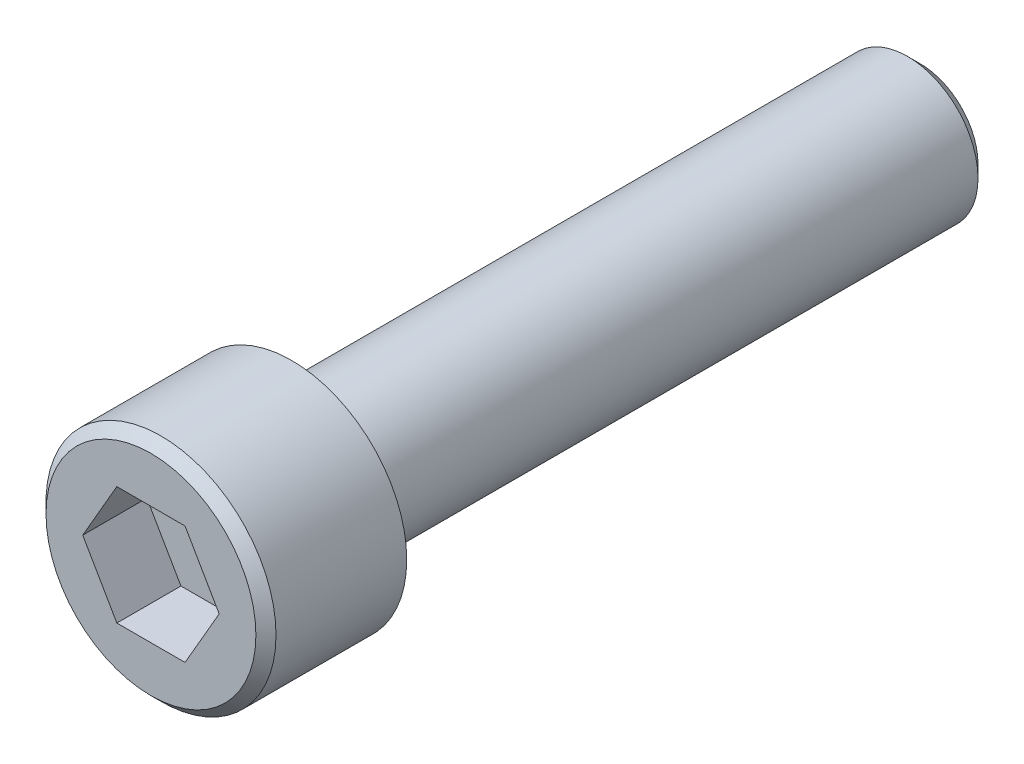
ISO-10303-21;
HEADER;
FILE_DESCRIPTION(('STEP AP214'),'2;1');
FILE_NAME('part.step','',(''),(''),'','','');
FILE_SCHEMA(('AUTOMOTIVE_DESIGN { 1 0 10303 214 1 1 1 1 }'));
ENDSEC;
DATA;
#1=APPLICATION_CONTEXT('core data for automotive mechanical design processes');
#2=APPLICATION_PROTOCOL_DEFINITION('international standard','automotive_design',2000,#1);
#3=PRODUCT_CONTEXT('',#1,'mechanical');
#4=PRODUCT('Part','Part','',(#3));
#5=PRODUCT_RELATED_PRODUCT_CATEGORY('part','',(#4));
#6=PRODUCT_DEFINITION_FORMATION('','',#4);
#7=PRODUCT_DEFINITION_CONTEXT('part definition',#1,'design');
#8=PRODUCT_DEFINITION('design','',#6,#7);
#9=PRODUCT_DEFINITION_SHAPE('','',#8);
#10=(LENGTH_UNIT() NAMED_UNIT(*) SI_UNIT(.MILLI.,.METRE.));
#11=(NAMED_UNIT(*) PLANE_ANGLE_UNIT() SI_UNIT($,.RADIAN.));
#12=(NAMED_UNIT(*) SI_UNIT($,.STERADIAN.) SOLID_ANGLE_UNIT());
#13=UNCERTAINTY_MEASURE_WITH_UNIT(LENGTH_MEASURE(1.E-05),#10,'distance_accuracy_value','');
#14=(GEOMETRIC_REPRESENTATION_CONTEXT(3) GLOBAL_UNCERTAINTY_ASSIGNED_CONTEXT((#13)) GLOBAL_UNIT_ASSIGNED_CONTEXT((#10,
#11,#12)) REPRESENTATION_CONTEXT('',''));
#15=CARTESIAN_POINT('',(0.,0.,0.));
#16=DIRECTION('',(0.,0.,1.));
#17=DIRECTION('',(1.,0.,0.));
#18=AXIS2_PLACEMENT_3D('',#15,#16,#17);
#19=CARTESIAN_POINT('',(-8.88178419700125E-13,-4.44089209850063E-13,-2.84480000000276));
#20=DIRECTION('',(0.,0.,0.999999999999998));
#21=DIRECTION('',(1.,0.,0.));
#22=AXIS2_PLACEMENT_3D('',#19,#20,#21);
#23=PLANE('',#22);
#24=CARTESIAN_POINT('',(-8.88178419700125E-13,-4.44089209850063E-13,-2.84480000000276));
#25=DIRECTION('',(0.,0.,0.999999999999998));
#26=DIRECTION('',(1.,0.,0.));
#27=AXIS2_PLACEMENT_3D('',#24,#25,#26);
#28=CIRCLE('',#27,2.3241);
#29=CARTESIAN_POINT('',(2.32409999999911,-4.43960196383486E-13,-2.84480000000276));
#30=VERTEX_POINT('',#29);
#31=EDGE_CURVE('E143',#30,#30,#28,.T.);
#32=ORIENTED_EDGE('',*,*,#31,.F.);
#33=EDGE_LOOP('',(#32));
#34=FACE_BOUND('',#33,.T.);
#35=CARTESIAN_POINT('',(-8.88178419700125E-13,-4.44089209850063E-13,-2.84480000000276));
#36=DIRECTION('',(0.,0.,0.999999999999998));
#37=DIRECTION('',(1.,0.,0.));
#38=AXIS2_PLACEMENT_3D('',#35,#36,#37);
#39=CIRCLE('',#38,1.4224);
#40=CARTESIAN_POINT('',(1.42239999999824,1.77643579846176E-12,-2.84480000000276));
#41=VERTEX_POINT('',#40);
#42=EDGE_CURVE('E151',#41,#41,#39,.F.);
#43=ORIENTED_EDGE('',*,*,#42,.F.);
#44=EDGE_LOOP('',(#43));
#45=FACE_BOUND('',#44,.T.);
#46=ADVANCED_FACE('F40',(#34,#45),#23,.F.);
#47=CARTESIAN_POINT('',(-8.88178419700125E-13,-4.44089209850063E-13,-2.84480000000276));
#48=DIRECTION('',(0.,0.,0.999999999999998));
#49=DIRECTION('',(1.,0.,0.));
#50=AXIS2_PLACEMENT_3D('',#47,#48,#49);
#51=CYLINDRICAL_SURFACE('',#50,2.3241);
#52=CARTESIAN_POINT('',(1.77635683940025E-12,4.44089209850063E-13,-0.203200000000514));
#53=DIRECTION('',(0.,0.,0.999999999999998));
#54=DIRECTION('',(1.,0.,0.));
#55=AXIS2_PLACEMENT_3D('',#52,#53,#54);
#56=CIRCLE('',#55,2.3241);
#57=CARTESIAN_POINT('',(2.32409999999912,-4.43960196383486E-13,-0.203200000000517));
#58=VERTEX_POINT('',#57);
#59=EDGE_CURVE('E11',#58,#58,#56,.F.);
#60=CARTESIAN_POINT('',(2.32409999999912,-4.43960196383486E-13,-0.203200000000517));
#61=CARTESIAN_POINT('',(2.32409999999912,-4.43960196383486E-13,-0.230716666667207));
#62=CARTESIAN_POINT('',(2.32409999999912,-4.43960196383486E-13,-0.258233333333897));
#63=CARTESIAN_POINT('',(2.32409999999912,-4.43960196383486E-13,-0.313266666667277));
#64=CARTESIAN_POINT('',(2.32409999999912,-4.43960196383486E-13,-0.340783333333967));
#65=CARTESIAN_POINT('',(2.32409999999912,-4.43960196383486E-13,-0.395816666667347));
#66=CARTESIAN_POINT('',(2.32409999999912,-4.43960196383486E-13,-0.423333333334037));
#67=CARTESIAN_POINT('',(2.32409999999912,-4.43960196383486E-13,-0.478366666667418));
#68=CARTESIAN_POINT('',(2.32409999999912,-4.43960196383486E-13,-0.505883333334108));
#69=CARTESIAN_POINT('',(2.32409999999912,-4.43960196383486E-13,-0.560916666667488));
#70=CARTESIAN_POINT('',(2.32409999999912,-4.43960196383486E-13,-0.588433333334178));
#71=CARTESIAN_POINT('',(2.32409999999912,-4.43960196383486E-13,-0.643466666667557));
#72=CARTESIAN_POINT('',(2.32409999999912,-4.43960196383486E-13,-0.670983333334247));
#73=CARTESIAN_POINT('',(2.32409999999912,-4.43960196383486E-13,-0.726016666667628));
#74=CARTESIAN_POINT('',(2.32409999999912,-4.43960196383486E-13,-0.753533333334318));
#75=CARTESIAN_POINT('',(2.32409999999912,-4.43960196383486E-13,-0.808566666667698));
#76=CARTESIAN_POINT('',(2.32409999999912,-4.43960196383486E-13,-0.836083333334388));
#77=CARTESIAN_POINT('',(2.32409999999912,-4.43960196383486E-13,-0.891116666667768));
#78=CARTESIAN_POINT('',(2.32409999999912,-4.43960196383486E-13,-0.918633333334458));
#79=CARTESIAN_POINT('',(2.32409999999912,-4.43960196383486E-13,-0.973666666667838));
#80=CARTESIAN_POINT('',(2.32409999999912,-4.43960196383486E-13,-1.00118333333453));
#81=CARTESIAN_POINT('',(2.32409999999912,-4.43960196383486E-13,-1.05621666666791));
#82=CARTESIAN_POINT('',(2.32409999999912,-4.43960196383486E-13,-1.0837333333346));
#83=CARTESIAN_POINT('',(2.32409999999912,-4.43960196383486E-13,-1.13876666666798));
#84=CARTESIAN_POINT('',(2.32409999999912,-4.43960196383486E-13,-1.16628333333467));
#85=CARTESIAN_POINT('',(2.32409999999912,-4.43960196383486E-13,-1.22131666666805));
#86=CARTESIAN_POINT('',(2.32409999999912,-4.43960196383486E-13,-1.24883333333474));
#87=CARTESIAN_POINT('',(2.32409999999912,-4.43960196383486E-13,-1.30386666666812));
#88=CARTESIAN_POINT('',(2.32409999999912,-4.43960196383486E-13,-1.33138333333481));
#89=CARTESIAN_POINT('',(2.32409999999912,-4.43960196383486E-13,-1.38641666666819));
#90=CARTESIAN_POINT('',(2.32409999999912,-4.43960196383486E-13,-1.41393333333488));
#91=CARTESIAN_POINT('',(2.32409999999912,-4.43960196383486E-13,-1.46896666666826));
#92=CARTESIAN_POINT('',(2.32409999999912,-4.43960196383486E-13,-1.49648333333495));
#93=CARTESIAN_POINT('',(2.32409999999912,-4.43960196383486E-13,-1.55151666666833));
#94=CARTESIAN_POINT('',(2.32409999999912,-4.43960196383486E-13,-1.57903333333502));
#95=CARTESIAN_POINT('',(2.32409999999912,-4.43960196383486E-13,-1.6340666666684));
#96=CARTESIAN_POINT('',(2.32409999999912,-4.43960196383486E-13,-1.66158333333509));
#97=CARTESIAN_POINT('',(2.32409999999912,-4.43960196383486E-13,-1.71661666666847));
#98=CARTESIAN_POINT('',(2.32409999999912,-4.43960196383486E-13,-1.74413333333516));
#99=CARTESIAN_POINT('',(2.32409999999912,-4.43960196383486E-13,-1.79916666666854));
#100=CARTESIAN_POINT('',(2.32409999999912,-4.43960196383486E-13,-1.82668333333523));
#101=CARTESIAN_POINT('',(2.32409999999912,-4.43960196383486E-13,-1.88171666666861));
#102=CARTESIAN_POINT('',(2.32409999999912,-4.43960196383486E-13,-1.9092333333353));
#103=CARTESIAN_POINT('',(2.32409999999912,-4.43960196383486E-13,-1.96426666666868));
#104=CARTESIAN_POINT('',(2.32409999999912,-4.43960196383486E-13,-1.99178333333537));
#105=CARTESIAN_POINT('',(2.32409999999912,-4.43960196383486E-13,-2.04681666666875));
#106=CARTESIAN_POINT('',(2.32409999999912,-4.43960196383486E-13,-2.07433333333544));
#107=CARTESIAN_POINT('',(2.32409999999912,-4.43960196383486E-13,-2.12936666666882));
#108=CARTESIAN_POINT('',(2.32409999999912,-4.43960196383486E-13,-2.15688333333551));
#109=CARTESIAN_POINT('',(2.32409999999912,-4.43960196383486E-13,-2.21191666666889));
#110=CARTESIAN_POINT('',(2.32409999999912,-4.43960196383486E-13,-2.23943333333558));
#111=CARTESIAN_POINT('',(2.32409999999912,-4.43960196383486E-13,-2.29446666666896));
#112=CARTESIAN_POINT('',(2.32409999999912,-4.43960196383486E-13,-2.32198333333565));
#113=CARTESIAN_POINT('',(2.32409999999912,-4.43960196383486E-13,-2.37701666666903));
#114=CARTESIAN_POINT('',(2.32409999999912,-4.43960196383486E-13,-2.40453333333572));
#115=CARTESIAN_POINT('',(2.32409999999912,-4.43960196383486E-13,-2.4595666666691));
#116=CARTESIAN_POINT('',(2.32409999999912,-4.43960196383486E-13,-2.48708333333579));
#117=CARTESIAN_POINT('',(2.32409999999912,-4.43960196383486E-13,-2.54211666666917));
#118=CARTESIAN_POINT('',(2.32409999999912,-4.43960196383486E-13,-2.56963333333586));
#119=CARTESIAN_POINT('',(2.32409999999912,-4.43960196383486E-13,-2.62466666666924));
#120=CARTESIAN_POINT('',(2.32409999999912,-4.43960196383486E-13,-2.65218333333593));
#121=CARTESIAN_POINT('',(2.32409999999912,-4.43960196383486E-13,-2.70721666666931));
#122=CARTESIAN_POINT('',(2.32409999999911,-4.43960196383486E-13,-2.734733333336));
#123=CARTESIAN_POINT('',(2.32409999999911,-4.43960196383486E-13,-2.78976666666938));
#124=CARTESIAN_POINT('',(2.32409999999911,-4.43960196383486E-13,-2.81728333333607));
#125=CARTESIAN_POINT('',(2.32409999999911,-4.43960196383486E-13,-2.84480000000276));
#126=B_SPLINE_CURVE_WITH_KNOTS('',3,(#60,#61,#62,#63,#64,#65,#66,#67,#68,#69,#70,#71,#72,#73,
#74,#75,#76,#77,#78,#79,#80,#81,#82,#83,#84,#85,#86,#87,#88,#89,#90,#91,#92,#93,#94,#95,#96,#97,
#98,#99,#100,#101,#102,#103,#104,#105,#106,#107,#108,#109,#110,#111,#112,#113,#114,#115,#116,
#117,#118,#119,#120,#121,#122,#123,#124,#125),.UNSPECIFIED.,.F.,.F.,(4,2,2,2,2,2,2,2,2,2,2,2,2,
2,2,2,2,2,2,2,2,2,2,2,2,2,2,2,2,2,2,2,4),(0.,0.0825500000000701,0.16510000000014,
0.24765000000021,0.330200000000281,0.41275000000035,0.49530000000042,0.577850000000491,
0.660400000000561,0.742950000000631,0.825500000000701,0.908050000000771,0.990600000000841,
1.07315000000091,1.15570000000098,1.23825000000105,1.32080000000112,1.40335000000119,
1.48590000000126,1.56845000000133,1.6510000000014,1.73355000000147,1.81610000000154,
1.89865000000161,1.98120000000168,2.06375000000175,2.14630000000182,2.22885000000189,
2.31140000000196,2.39395000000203,2.4765000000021,2.55905000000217,2.64160000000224),.UNSPECIFIED.);
#127=EDGE_CURVE('BSEAM179',#58,#30,#126,.T.);
#128=ORIENTED_EDGE('',*,*,#59,.T.);
#129=ORIENTED_EDGE('',*,*,#31,.T.);
#130=ORIENTED_EDGE('',*,*,#127,.T.);
#131=ORIENTED_EDGE('',*,*,#127,.F.);
#132=EDGE_LOOP('',(#128,#130,#129,#131));
#133=FACE_BOUND('',#132,.T.);
#134=ADVANCED_FACE('F179',(#133),#51,.T.);
#135=CARTESIAN_POINT('',(0.,0.,0.));
#136=DIRECTION('',(0.,0.,0.999999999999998));
#137=DIRECTION('',(1.,0.,0.));
#138=AXIS2_PLACEMENT_3D('',#135,#136,#137);
#139=PLANE('',#138);
#140=CARTESIAN_POINT('',(0.,0.,0.));
#141=DIRECTION('',(0.,0.,0.999999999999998));
#142=DIRECTION('',(1.,0.,0.));
#143=AXIS2_PLACEMENT_3D('',#140,#141,#142);
#144=CIRCLE('',#143,2.1209);
#145=CARTESIAN_POINT('',(2.1209,0.,0.));
#146=VERTEX_POINT('',#145);
#147=EDGE_CURVE('E49',#146,#146,#144,.T.);
#148=ORIENTED_EDGE('',*,*,#147,.T.);
#149=EDGE_LOOP('',(#148));
#150=FACE_BOUND('',#149,.T.);
#151=DIRECTION('',(0.5,0.866025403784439,0.));
#152=VECTOR('',#151,1.);
#153=CARTESIAN_POINT('',(0.689240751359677,-1.19379999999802,-8.88178419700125E-13));
#154=LINE('',#153,#152);
#155=CARTESIAN_POINT('',(0.689240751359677,-1.19379999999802,-8.88178419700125E-13));
#156=VERTEX_POINT('',#155);
#157=CARTESIAN_POINT('',(1.37848150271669,1.77635683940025E-12,-1.77635683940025E-12));
#158=VERTEX_POINT('',#157);
#159=EDGE_CURVE('E56',#156,#158,#154,.T.);
#160=ORIENTED_EDGE('',*,*,#159,.F.);
#161=DIRECTION('',(1.,0.,0.));
#162=VECTOR('',#161,1.);
#163=CARTESIAN_POINT('',(-0.6892407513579,-1.19379999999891,-1.77635683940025E-12));
#164=LINE('',#163,#162);
#165=CARTESIAN_POINT('',(-0.6892407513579,-1.19379999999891,-1.77635683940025E-12));
#166=VERTEX_POINT('',#165);
#167=EDGE_CURVE('E139',#166,#156,#164,.T.);
#168=ORIENTED_EDGE('',*,*,#167,.F.);
#169=DIRECTION('',(0.500000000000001,-0.866025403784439,0.));
#170=VECTOR('',#169,1.);
#171=CARTESIAN_POINT('',(-1.3784815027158,1.33226762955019E-12,-1.77635683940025E-12));
#172=LINE('',#171,#170);
#173=CARTESIAN_POINT('',(-1.3784815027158,1.33226762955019E-12,-1.77635683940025E-12));
#174=VERTEX_POINT('',#173);
#175=EDGE_CURVE('E137',#174,#166,#172,.T.);
#176=ORIENTED_EDGE('',*,*,#175,.F.);
#177=DIRECTION('',(-0.500000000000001,-0.866025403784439,0.));
#178=VECTOR('',#177,1.);
#179=CARTESIAN_POINT('',(-0.689240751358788,1.19380000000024,-8.88178419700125E-13));
#180=LINE('',#179,#178);
#181=CARTESIAN_POINT('',(-0.689240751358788,1.19380000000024,-8.88178419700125E-13));
#182=VERTEX_POINT('',#181);
#183=EDGE_CURVE('E104',#182,#174,#180,.T.);
#184=ORIENTED_EDGE('',*,*,#183,.F.);
#185=DIRECTION('',(-1.,0.,0.));
#186=VECTOR('',#185,1.);
#187=CARTESIAN_POINT('',(0.689240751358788,1.19379999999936,-1.77635683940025E-12));
#188=LINE('',#187,#186);
#189=CARTESIAN_POINT('',(0.689240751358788,1.19379999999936,-1.77635683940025E-12));
#190=VERTEX_POINT('',#189);
#191=EDGE_CURVE('E133',#190,#182,#188,.T.);
#192=ORIENTED_EDGE('',*,*,#191,.F.);
#193=DIRECTION('',(-0.500000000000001,0.866025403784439,0.));
#194=VECTOR('',#193,1.);
#195=CARTESIAN_POINT('',(1.37848150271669,1.77635683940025E-12,-1.77635683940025E-12));
#196=LINE('',#195,#194);
#197=EDGE_CURVE('E130',#158,#190,#196,.T.);
#198=ORIENTED_EDGE('',*,*,#197,.F.);
#199=EDGE_LOOP('',(#160,#168,#176,#184,#192,#198));
#200=FACE_BOUND('',#199,.T.);
#201=ADVANCED_FACE('F163',(#150,#200),#139,.T.);
#202=CARTESIAN_POINT('',(-1.77635683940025E-12,1.77635683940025E-12,-15.5448000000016));
#203=DIRECTION('',(0.,0.,0.999999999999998));
#204=DIRECTION('',(1.,0.,0.));
#205=AXIS2_PLACEMENT_3D('',#202,#203,#204);
#206=CYLINDRICAL_SURFACE('',#205,1.4224);
#207=CARTESIAN_POINT('',(-2.66453525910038E-12,1.33226762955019E-12,-15.2908000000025));
#208=DIRECTION('',(0.,0.,-0.999999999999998));
#209=DIRECTION('',(-1.,0.,0.));
#210=AXIS2_PLACEMENT_3D('',#207,#208,#209);
#211=CIRCLE('',#210,1.4224);
#212=CARTESIAN_POINT('',(1.42239999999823,1.77643579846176E-12,-15.2908000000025));
#213=VERTEX_POINT('',#212);
#214=EDGE_CURVE('E157',#213,#213,#211,.F.);
#215=CARTESIAN_POINT('',(1.42239999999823,1.77643579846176E-12,-15.2908000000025));
#216=CARTESIAN_POINT('',(1.42239999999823,1.77643579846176E-12,-15.1611541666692));
#217=CARTESIAN_POINT('',(1.42239999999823,1.77643579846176E-12,-15.0315083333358));
#218=CARTESIAN_POINT('',(1.42239999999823,1.77643579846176E-12,-14.7722166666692));
#219=CARTESIAN_POINT('',(1.42239999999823,1.77643579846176E-12,-14.6425708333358));
#220=CARTESIAN_POINT('',(1.42239999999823,1.77643579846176E-12,-14.3832791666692));
#221=CARTESIAN_POINT('',(1.42239999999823,1.77643579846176E-12,-14.2536333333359));
#222=CARTESIAN_POINT('',(1.42239999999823,1.77643579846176E-12,-13.9943416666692));
#223=CARTESIAN_POINT('',(1.42239999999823,1.77643579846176E-12,-13.8646958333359));
#224=CARTESIAN_POINT('',(1.42239999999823,1.77643579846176E-12,-13.6054041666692));
#225=CARTESIAN_POINT('',(1.42239999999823,1.77643579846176E-12,-13.4757583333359));
#226=CARTESIAN_POINT('',(1.42239999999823,1.77643579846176E-12,-13.2164666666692));
#227=CARTESIAN_POINT('',(1.42239999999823,1.77643579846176E-12,-13.0868208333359));
#228=CARTESIAN_POINT('',(1.42239999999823,1.77643579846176E-12,-12.8275291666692));
#229=CARTESIAN_POINT('',(1.42239999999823,1.77643579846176E-12,-12.6978833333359));
#230=CARTESIAN_POINT('',(1.42239999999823,1.77643579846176E-12,-12.4385916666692));
#231=CARTESIAN_POINT('',(1.42239999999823,1.77643579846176E-12,-12.3089458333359));
#232=CARTESIAN_POINT('',(1.42239999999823,1.77643579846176E-12,-12.0496541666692));
#233=CARTESIAN_POINT('',(1.42239999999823,1.77643579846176E-12,-11.9200083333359));
#234=CARTESIAN_POINT('',(1.42239999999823,1.77643579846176E-12,-11.6607166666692));
#235=CARTESIAN_POINT('',(1.42239999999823,1.77643579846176E-12,-11.5310708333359));
#236=CARTESIAN_POINT('',(1.42239999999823,1.77643579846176E-12,-11.2717791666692));
#237=CARTESIAN_POINT('',(1.42239999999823,1.77643579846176E-12,-11.1421333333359));
#238=CARTESIAN_POINT('',(1.42239999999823,1.77643579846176E-12,-10.8828416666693));
#239=CARTESIAN_POINT('',(1.42239999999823,1.77643579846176E-12,-10.7531958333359));
#240=CARTESIAN_POINT('',(1.42239999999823,1.77643579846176E-12,-10.4939041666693));
#241=CARTESIAN_POINT('',(1.42239999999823,1.77643579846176E-12,-10.3642583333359));
#242=CARTESIAN_POINT('',(1.42239999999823,1.77643579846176E-12,-10.1049666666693));
#243=CARTESIAN_POINT('',(1.42239999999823,1.77643579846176E-12,-9.97532083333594));
#244=CARTESIAN_POINT('',(1.42239999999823,1.77643579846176E-12,-9.71602916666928));
#245=CARTESIAN_POINT('',(1.42239999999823,1.77643579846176E-12,-9.58638333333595));
#246=CARTESIAN_POINT('',(1.42239999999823,1.77643579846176E-12,-9.32709166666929));
#247=CARTESIAN_POINT('',(1.42239999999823,1.77643579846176E-12,-9.19744583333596));
#248=CARTESIAN_POINT('',(1.42239999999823,1.77643579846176E-12,-8.9381541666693));
#249=CARTESIAN_POINT('',(1.42239999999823,1.77643579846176E-12,-8.80850833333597));
#250=CARTESIAN_POINT('',(1.42239999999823,1.77643579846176E-12,-8.5492166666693));
#251=CARTESIAN_POINT('',(1.42239999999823,1.77643579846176E-12,-8.41957083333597));
#252=CARTESIAN_POINT('',(1.42239999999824,1.77643579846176E-12,-8.16027916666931));
#253=CARTESIAN_POINT('',(1.42239999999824,1.77643579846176E-12,-8.03063333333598));
#254=CARTESIAN_POINT('',(1.42239999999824,1.77643579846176E-12,-7.77134166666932));
#255=CARTESIAN_POINT('',(1.42239999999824,1.77643579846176E-12,-7.64169583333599));
#256=CARTESIAN_POINT('',(1.42239999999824,1.77643579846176E-12,-7.38240416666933));
#257=CARTESIAN_POINT('',(1.42239999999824,1.77643579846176E-12,-7.252758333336));
#258=CARTESIAN_POINT('',(1.42239999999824,1.77643579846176E-12,-6.99346666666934));
#259=CARTESIAN_POINT('',(1.42239999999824,1.77643579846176E-12,-6.86382083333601));
#260=CARTESIAN_POINT('',(1.42239999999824,1.77643579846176E-12,-6.60452916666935));
#261=CARTESIAN_POINT('',(1.42239999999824,1.77643579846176E-12,-6.47488333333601));
#262=CARTESIAN_POINT('',(1.42239999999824,1.77643579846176E-12,-6.21559166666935));
#263=CARTESIAN_POINT('',(1.42239999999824,1.77643579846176E-12,-6.08594583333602));
#264=CARTESIAN_POINT('',(1.42239999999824,1.77643579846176E-12,-5.82665416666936));
#265=CARTESIAN_POINT('',(1.42239999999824,1.77643579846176E-12,-5.69700833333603));
#266=CARTESIAN_POINT('',(1.42239999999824,1.77643579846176E-12,-5.43771666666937));
#267=CARTESIAN_POINT('',(1.42239999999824,1.77643579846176E-12,-5.30807083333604));
#268=CARTESIAN_POINT('',(1.42239999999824,1.77643579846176E-12,-5.04877916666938));
#269=CARTESIAN_POINT('',(1.42239999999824,1.77643579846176E-12,-4.91913333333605));
#270=CARTESIAN_POINT('',(1.42239999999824,1.77643579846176E-12,-4.65984166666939));
#271=CARTESIAN_POINT('',(1.42239999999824,1.77643579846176E-12,-4.53019583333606));
#272=CARTESIAN_POINT('',(1.42239999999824,1.77643579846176E-12,-4.2709041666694));
#273=CARTESIAN_POINT('',(1.42239999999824,1.77643579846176E-12,-4.14125833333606));
#274=CARTESIAN_POINT('',(1.42239999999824,1.77643579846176E-12,-3.8819666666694));
#275=CARTESIAN_POINT('',(1.42239999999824,1.77643579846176E-12,-3.75232083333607));
#276=CARTESIAN_POINT('',(1.42239999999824,1.77643579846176E-12,-3.49302916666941));
#277=CARTESIAN_POINT('',(1.42239999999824,1.77643579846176E-12,-3.36338333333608));
#278=CARTESIAN_POINT('',(1.42239999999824,1.77643579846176E-12,-3.10409166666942));
#279=CARTESIAN_POINT('',(1.42239999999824,1.77643579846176E-12,-2.97444583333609));
#280=CARTESIAN_POINT('',(1.42239999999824,1.77643579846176E-12,-2.84480000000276));
#281=B_SPLINE_CURVE_WITH_KNOTS('',3,(#215,#216,#217,#218,#219,#220,#221,#222,#223,#224,#225,
#226,#227,#228,#229,#230,#231,#232,#233,#234,#235,#236,#237,#238,#239,#240,#241,#242,#243,#244,
#245,#246,#247,#248,#249,#250,#251,#252,#253,#254,#255,#256,#257,#258,#259,#260,#261,#262,#263,
#264,#265,#266,#267,#268,#269,#270,#271,#272,#273,#274,#275,#276,#277,#278,#279,#280),
.UNSPECIFIED.,.F.,.F.,(4,2,2,2,2,2,2,2,2,2,2,2,2,2,2,2,2,2,2,2,2,2,2,2,2,2,2,2,2,2,2,2,4),(0.,
0.38893749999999,0.777874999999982,1.16681249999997,1.55574999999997,1.94468749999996,
2.33362499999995,2.72256249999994,3.11149999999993,3.50043749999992,3.88937499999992,
4.27831249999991,4.6672499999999,5.05618749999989,5.44512499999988,5.83406249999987,
6.22299999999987,6.61193749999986,7.00087499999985,7.38981249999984,7.77874999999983,
8.16768749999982,8.55662499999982,8.94556249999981,9.3344999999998,9.72343749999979,
10.1123749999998,10.5013124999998,10.8902499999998,11.2791874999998,11.6681249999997,
12.0570624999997,12.4459999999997),.UNSPECIFIED.);
#282=EDGE_CURVE('BSEAM191',#213,#41,#281,.T.);
#283=ORIENTED_EDGE('',*,*,#214,.T.);
#284=ORIENTED_EDGE('',*,*,#42,.T.);
#285=ORIENTED_EDGE('',*,*,#282,.T.);
#286=ORIENTED_EDGE('',*,*,#282,.F.);
#287=EDGE_LOOP('',(#283,#285,#284,#286));
#288=FACE_BOUND('',#287,.T.);
#289=ADVANCED_FACE('F191',(#288),#206,.T.);
#290=CARTESIAN_POINT('',(-1.77635683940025E-12,1.77635683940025E-12,-15.5448000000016));
#291=DIRECTION('',(0.,0.,-0.999999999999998));
#292=DIRECTION('',(-1.,0.,0.));
#293=AXIS2_PLACEMENT_3D('',#290,#291,#292);
#294=PLANE('',#293);
#295=CARTESIAN_POINT('',(-1.77635683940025E-12,1.77635683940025E-12,-15.5448000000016));
#296=DIRECTION('',(0.,0.,-0.999999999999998));
#297=DIRECTION('',(-1.,0.,0.));
#298=AXIS2_PLACEMENT_3D('',#295,#296,#297);
#299=CIRCLE('',#298,0.3937);
#300=CARTESIAN_POINT('',(-0.393700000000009,0.,-15.5448000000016));
#301=VERTEX_POINT('',#300);
#302=EDGE_CURVE('E237',#301,#301,#299,.T.);
#303=ORIENTED_EDGE('',*,*,#302,.F.);
#304=EDGE_LOOP('',(#303));
#305=FACE_BOUND('',#304,.T.);
#306=CARTESIAN_POINT('',(-1.77635683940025E-12,1.77635683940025E-12,-15.5448000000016));
#307=DIRECTION('',(0.,0.,-0.999999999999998));
#308=DIRECTION('',(-1.,0.,0.));
#309=AXIS2_PLACEMENT_3D('',#306,#307,#308);
#310=CIRCLE('',#309,1.1684);
#311=CARTESIAN_POINT('',(1.16839999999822,1.77642169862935E-12,-15.5448000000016));
#312=VERTEX_POINT('',#311);
#313=EDGE_CURVE('E154',#312,#312,#310,.T.);
#314=ORIENTED_EDGE('',*,*,#313,.T.);
#315=EDGE_LOOP('',(#314));
#316=FACE_BOUND('',#315,.T.);
#317=ADVANCED_FACE('F197',(#305,#316),#294,.T.);
#318=CARTESIAN_POINT('',(0.689240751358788,-1.1937999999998,-1.29540000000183));
#319=DIRECTION('',(0.86602540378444,-0.499999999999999,0.));
#320=DIRECTION('',(0.5,0.866025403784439,0.));
#321=AXIS2_PLACEMENT_3D('',#318,#319,#320);
#322=PLANE('',#321);
#323=ORIENTED_EDGE('',*,*,#159,.T.);
#324=DIRECTION('',(0.,0.,0.999999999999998));
#325=VECTOR('',#324,1.);
#326=CARTESIAN_POINT('',(1.37848150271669,0.,-1.29540000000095));
#327=LINE('',#326,#325);
#328=CARTESIAN_POINT('',(1.37848150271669,0.,-1.29540000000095));
#329=VERTEX_POINT('',#328);
#330=EDGE_CURVE('E86',#329,#158,#327,.T.);
#331=ORIENTED_EDGE('',*,*,#330,.F.);
#332=DIRECTION('',(0.5,0.866025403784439,0.));
#333=VECTOR('',#332,1.);
#334=CARTESIAN_POINT('',(0.689240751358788,-1.1937999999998,-1.29540000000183));
#335=LINE('',#334,#333);
#336=CARTESIAN_POINT('',(0.689240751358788,-1.1937999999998,-1.29540000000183));
#337=VERTEX_POINT('',#336);
#338=EDGE_CURVE('E141',#337,#329,#335,.T.);
#339=ORIENTED_EDGE('',*,*,#338,.F.);
#340=DIRECTION('',(0.,0.,0.999999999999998));
#341=VECTOR('',#340,1.);
#342=CARTESIAN_POINT('',(0.689240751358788,-1.1937999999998,-1.29540000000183));
#343=LINE('',#342,#341);
#344=EDGE_CURVE('E64',#337,#156,#343,.T.);
#345=ORIENTED_EDGE('',*,*,#344,.T.);
#346=EDGE_LOOP('',(#323,#331,#339,#345));
#347=FACE_BOUND('',#346,.T.);
#348=ADVANCED_FACE('F202',(#347),#322,.F.);
#349=CARTESIAN_POINT('',(-0.6892407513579,-1.1937999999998,-1.29540000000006));
#350=DIRECTION('',(0.,-1.,0.));
#351=DIRECTION('',(0.,0.,-0.999999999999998));
#352=AXIS2_PLACEMENT_3D('',#349,#350,#351);
#353=PLANE('',#352);
#354=ORIENTED_EDGE('',*,*,#167,.T.);
#355=ORIENTED_EDGE('',*,*,#344,.F.);
#356=DIRECTION('',(1.,0.,0.));
#357=VECTOR('',#356,1.);
#358=CARTESIAN_POINT('',(-0.6892407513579,-1.1937999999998,-1.29540000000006));
#359=LINE('',#358,#357);
#360=CARTESIAN_POINT('',(-0.6892407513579,-1.1937999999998,-1.29540000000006));
#361=VERTEX_POINT('',#360);
#362=EDGE_CURVE('E116',#361,#337,#359,.T.);
#363=ORIENTED_EDGE('',*,*,#362,.F.);
#364=DIRECTION('',(0.,0.,0.999999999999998));
#365=VECTOR('',#364,1.);
#366=CARTESIAN_POINT('',(-0.6892407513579,-1.1937999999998,-1.29540000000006));
#367=LINE('',#366,#365);
#368=EDGE_CURVE('E108',#361,#166,#367,.T.);
#369=ORIENTED_EDGE('',*,*,#368,.T.);
#370=EDGE_LOOP('',(#354,#355,#363,#369));
#371=FACE_BOUND('',#370,.T.);
#372=ADVANCED_FACE('F213',(#371),#353,.F.);
#373=CARTESIAN_POINT('',(-1.37848150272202,4.44089209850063E-13,-1.29540000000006));
#374=DIRECTION('',(-0.866025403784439,-0.5,0.));
#375=DIRECTION('',(0.5,-0.866025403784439,0.));
#376=AXIS2_PLACEMENT_3D('',#373,#374,#375);
#377=PLANE('',#376);
#378=ORIENTED_EDGE('',*,*,#175,.T.);
#379=ORIENTED_EDGE('',*,*,#368,.F.);
#380=DIRECTION('',(0.500000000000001,-0.866025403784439,0.));
#381=VECTOR('',#380,1.);
#382=CARTESIAN_POINT('',(-1.37848150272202,4.44089209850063E-13,-1.29540000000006));
#383=LINE('',#382,#381);
#384=CARTESIAN_POINT('',(-1.37848150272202,4.44089209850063E-13,-1.29540000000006));
#385=VERTEX_POINT('',#384);
#386=EDGE_CURVE('E112',#385,#361,#383,.T.);
#387=ORIENTED_EDGE('',*,*,#386,.F.);
#388=DIRECTION('',(0.,0.,0.999999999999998));
#389=VECTOR('',#388,1.);
#390=CARTESIAN_POINT('',(-1.37848150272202,4.44089209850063E-13,-1.29540000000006));
#391=LINE('',#390,#389);
#392=EDGE_CURVE('E97',#385,#174,#391,.T.);
#393=ORIENTED_EDGE('',*,*,#392,.T.);
#394=EDGE_LOOP('',(#378,#379,#387,#393));
#395=FACE_BOUND('',#394,.T.);
#396=ADVANCED_FACE('F113',(#395),#377,.F.);
#397=CARTESIAN_POINT('',(-0.689240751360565,1.19380000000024,-1.29539999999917));
#398=DIRECTION('',(-0.866025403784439,0.5,0.));
#399=DIRECTION('',(-0.500000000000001,-0.866025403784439,0.));
#400=AXIS2_PLACEMENT_3D('',#397,#398,#399);
#401=PLANE('',#400);
#402=ORIENTED_EDGE('',*,*,#183,.T.);
#403=ORIENTED_EDGE('',*,*,#392,.F.);
#404=DIRECTION('',(-0.500000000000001,-0.866025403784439,0.));
#405=VECTOR('',#404,1.);
#406=CARTESIAN_POINT('',(-0.689240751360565,1.19380000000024,-1.29539999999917));
#407=LINE('',#406,#405);
#408=CARTESIAN_POINT('',(-0.689240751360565,1.19380000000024,-1.29539999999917));
#409=VERTEX_POINT('',#408);
#410=EDGE_CURVE('E101',#409,#385,#407,.T.);
#411=ORIENTED_EDGE('',*,*,#410,.F.);
#412=DIRECTION('',(0.,0.,0.999999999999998));
#413=VECTOR('',#412,1.);
#414=CARTESIAN_POINT('',(-0.689240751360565,1.19380000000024,-1.29539999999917));
#415=LINE('',#414,#413);
#416=EDGE_CURVE('E109',#409,#182,#415,.T.);
#417=ORIENTED_EDGE('',*,*,#416,.T.);
#418=EDGE_LOOP('',(#402,#403,#411,#417));
#419=FACE_BOUND('',#418,.T.);
#420=ADVANCED_FACE('F99',(#419),#401,.F.);
#421=CARTESIAN_POINT('',(0.689240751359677,1.19380000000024,-1.29540000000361));
#422=DIRECTION('',(0.,1.,0.));
#423=DIRECTION('',(0.,0.,0.999999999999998));
#424=AXIS2_PLACEMENT_3D('',#421,#422,#423);
#425=PLANE('',#424);
#426=ORIENTED_EDGE('',*,*,#191,.T.);
#427=ORIENTED_EDGE('',*,*,#416,.F.);
#428=DIRECTION('',(-1.,0.,0.));
#429=VECTOR('',#428,1.);
#430=CARTESIAN_POINT('',(0.689240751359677,1.19380000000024,-1.29540000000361));
#431=LINE('',#430,#429);
#432=CARTESIAN_POINT('',(0.689240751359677,1.19380000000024,-1.29540000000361));
#433=VERTEX_POINT('',#432);
#434=EDGE_CURVE('E122',#433,#409,#431,.T.);
#435=ORIENTED_EDGE('',*,*,#434,.F.);
#436=DIRECTION('',(0.,0.,0.999999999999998));
#437=VECTOR('',#436,1.);
#438=CARTESIAN_POINT('',(0.689240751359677,1.19380000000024,-1.29540000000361));
#439=LINE('',#438,#437);
#440=EDGE_CURVE('E146',#433,#190,#439,.T.);
#441=ORIENTED_EDGE('',*,*,#440,.T.);
#442=EDGE_LOOP('',(#426,#427,#435,#441));
#443=FACE_BOUND('',#442,.T.);
#444=ADVANCED_FACE('F220',(#443),#425,.F.);
#445=CARTESIAN_POINT('',(1.37848150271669,0.,-1.29540000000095));
#446=DIRECTION('',(0.866025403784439,0.5,0.));
#447=DIRECTION('',(-0.5,0.866025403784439,0.));
#448=AXIS2_PLACEMENT_3D('',#445,#446,#447);
#449=PLANE('',#448);
#450=ORIENTED_EDGE('',*,*,#197,.T.);
#451=ORIENTED_EDGE('',*,*,#440,.F.);
#452=DIRECTION('',(-0.500000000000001,0.866025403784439,0.));
#453=VECTOR('',#452,1.);
#454=CARTESIAN_POINT('',(1.37848150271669,0.,-1.29540000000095));
#455=LINE('',#454,#453);
#456=EDGE_CURVE('E124',#329,#433,#455,.T.);
#457=ORIENTED_EDGE('',*,*,#456,.F.);
#458=ORIENTED_EDGE('',*,*,#330,.T.);
#459=EDGE_LOOP('',(#450,#451,#457,#458));
#460=FACE_BOUND('',#459,.T.);
#461=ADVANCED_FACE('F217',(#460),#449,.F.);
#462=CARTESIAN_POINT('',(2.06772225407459,1.19380000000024,-1.29540000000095));
#463=DIRECTION('',(0.,0.,0.999999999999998));
#464=DIRECTION('',(1.,0.,0.));
#465=AXIS2_PLACEMENT_3D('',#462,#463,#464);
#466=PLANE('',#465);
#467=CARTESIAN_POINT('',(-8.88178419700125E-13,-8.88178419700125E-13,-1.29540000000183));
#468=DIRECTION('',(0.,0.,0.999999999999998));
#469=DIRECTION('',(1.,0.,0.));
#470=AXIS2_PLACEMENT_3D('',#467,#468,#469);
#471=CIRCLE('',#470,0.3937);
#472=CARTESIAN_POINT('',(-0.393700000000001,0.,-1.29540000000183));
#473=VERTEX_POINT('',#472);
#474=EDGE_CURVE('E44',#473,#473,#471,.T.);
#475=ORIENTED_EDGE('',*,*,#474,.F.);
#476=EDGE_LOOP('',(#475));
#477=FACE_BOUND('',#476,.T.);
#478=ORIENTED_EDGE('',*,*,#338,.T.);
#479=ORIENTED_EDGE('',*,*,#456,.T.);
#480=ORIENTED_EDGE('',*,*,#434,.T.);
#481=ORIENTED_EDGE('',*,*,#410,.T.);
#482=ORIENTED_EDGE('',*,*,#386,.T.);
#483=ORIENTED_EDGE('',*,*,#362,.T.);
#484=EDGE_LOOP('',(#478,#479,#480,#481,#482,#483));
#485=FACE_BOUND('',#484,.T.);
#486=ADVANCED_FACE('F119',(#477,#485),#466,.T.);
#487=CARTESIAN_POINT('',(-1.77635683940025E-12,1.77635683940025E-12,-15.5448000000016));
#488=DIRECTION('',(0.,0.,0.999999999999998));
#489=DIRECTION('',(1.,0.,0.));
#490=AXIS2_PLACEMENT_3D('',#487,#488,#489);
#491=CONICAL_SURFACE('',#490,1.1684,0.785398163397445);
#492=CARTESIAN_POINT('',(1.42239999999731,1.77643579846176E-12,-15.2908000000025));
#493=CARTESIAN_POINT('',(1.41975416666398,1.77643565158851E-12,-15.2934458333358));
#494=CARTESIAN_POINT('',(1.41710833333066,1.77643550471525E-12,-15.2960916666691));
#495=CARTESIAN_POINT('',(1.41181666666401,1.77643521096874E-12,-15.3013833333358));
#496=CARTESIAN_POINT('',(1.40917083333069,1.77643506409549E-12,-15.3040291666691));
#497=CARTESIAN_POINT('',(1.40387916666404,1.77643477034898E-12,-15.3093208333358));
#498=CARTESIAN_POINT('',(1.40123333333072,1.77643462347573E-12,-15.3119666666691));
#499=CARTESIAN_POINT('',(1.39594166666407,1.77643432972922E-12,-15.3172583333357));
#500=CARTESIAN_POINT('',(1.39329583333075,1.77643418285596E-12,-15.3199041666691));
#501=CARTESIAN_POINT('',(1.3880041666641,1.77643388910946E-12,-15.3251958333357));
#502=CARTESIAN_POINT('',(1.38535833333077,1.7764337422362E-12,-15.327841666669));
#503=CARTESIAN_POINT('',(1.38006666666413,1.77643344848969E-12,-15.3331333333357));
#504=CARTESIAN_POINT('',(1.3774208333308,1.77643330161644E-12,-15.335779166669));
#505=CARTESIAN_POINT('',(1.37212916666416,1.77643300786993E-12,-15.3410708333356));
#506=CARTESIAN_POINT('',(1.36948333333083,1.77643286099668E-12,-15.343716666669));
#507=CARTESIAN_POINT('',(1.36419166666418,1.77643256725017E-12,-15.3490083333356));
#508=CARTESIAN_POINT('',(1.36154583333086,1.77643242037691E-12,-15.3516541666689));
#509=CARTESIAN_POINT('',(1.35625416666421,1.7764321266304E-12,-15.3569458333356));
#510=CARTESIAN_POINT('',(1.35360833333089,1.77643197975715E-12,-15.3595916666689));
#511=CARTESIAN_POINT('',(1.34831666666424,1.77643168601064E-12,-15.3648833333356));
#512=CARTESIAN_POINT('',(1.34567083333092,1.77643153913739E-12,-15.3675291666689));
#513=CARTESIAN_POINT('',(1.34037916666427,1.77643124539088E-12,-15.3728208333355));
#514=CARTESIAN_POINT('',(1.33773333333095,1.77643109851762E-12,-15.3754666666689));
#515=CARTESIAN_POINT('',(1.3324416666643,1.77643080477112E-12,-15.3807583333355));
#516=CARTESIAN_POINT('',(1.32979583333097,1.77643065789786E-12,-15.3834041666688));
#517=CARTESIAN_POINT('',(1.32450416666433,1.77643036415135E-12,-15.3886958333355));
#518=CARTESIAN_POINT('',(1.321858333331,1.7764302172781E-12,-15.3913416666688));
#519=CARTESIAN_POINT('',(1.31656666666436,1.77642992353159E-12,-15.3966333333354));
#520=CARTESIAN_POINT('',(1.31392083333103,1.77642977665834E-12,-15.3992791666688));
#521=CARTESIAN_POINT('',(1.30862916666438,1.77642948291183E-12,-15.4045708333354));
#522=CARTESIAN_POINT('',(1.30598333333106,1.77642933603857E-12,-15.4072166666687));
#523=CARTESIAN_POINT('',(1.30069166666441,1.77642904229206E-12,-15.4125083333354));
#524=CARTESIAN_POINT('',(1.29804583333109,1.77642889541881E-12,-15.4151541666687));
#525=CARTESIAN_POINT('',(1.29275416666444,1.7764286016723E-12,-15.4204458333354));
#526=CARTESIAN_POINT('',(1.29010833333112,1.77642845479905E-12,-15.4230916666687));
#527=CARTESIAN_POINT('',(1.28481666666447,1.77642816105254E-12,-15.4283833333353));
#528=CARTESIAN_POINT('',(1.28217083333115,1.77642801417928E-12,-15.4310291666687));
#529=CARTESIAN_POINT('',(1.2768791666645,1.77642772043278E-12,-15.4363208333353));
#530=CARTESIAN_POINT('',(1.27423333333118,1.77642757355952E-12,-15.4389666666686));
#531=CARTESIAN_POINT('',(1.26894166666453,1.77642727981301E-12,-15.4442583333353));
#532=CARTESIAN_POINT('',(1.2662958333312,1.77642713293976E-12,-15.4469041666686));
#533=CARTESIAN_POINT('',(1.26100416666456,1.77642683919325E-12,-15.4521958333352));
#534=CARTESIAN_POINT('',(1.25835833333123,1.77642669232E-12,-15.4548416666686));
#535=CARTESIAN_POINT('',(1.25306666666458,1.77642639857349E-12,-15.4601333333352));
#536=CARTESIAN_POINT('',(1.25042083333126,1.77642625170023E-12,-15.4627791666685));
#537=CARTESIAN_POINT('',(1.24512916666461,1.77642595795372E-12,-15.4680708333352));
#538=CARTESIAN_POINT('',(1.24248333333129,1.77642581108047E-12,-15.4707166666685));
#539=CARTESIAN_POINT('',(1.23719166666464,1.77642551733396E-12,-15.4760083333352));
#540=CARTESIAN_POINT('',(1.23454583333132,1.77642537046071E-12,-15.4786541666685));
#541=CARTESIAN_POINT('',(1.22925416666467,1.7764250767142E-12,-15.4839458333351));
#542=CARTESIAN_POINT('',(1.22660833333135,1.77642492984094E-12,-15.4865916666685));
#543=CARTESIAN_POINT('',(1.2213166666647,1.77642463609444E-12,-15.4918833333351));
#544=CARTESIAN_POINT('',(1.21867083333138,1.77642448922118E-12,-15.4945291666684));
#545=CARTESIAN_POINT('',(1.21337916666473,1.77642419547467E-12,-15.4998208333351));
#546=CARTESIAN_POINT('',(1.2107333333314,1.77642404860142E-12,-15.5024666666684));
#547=CARTESIAN_POINT('',(1.20544166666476,1.77642375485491E-12,-15.507758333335));
#548=CARTESIAN_POINT('',(1.20279583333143,1.77642360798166E-12,-15.5104041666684));
#549=CARTESIAN_POINT('',(1.19750416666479,1.77642331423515E-12,-15.515695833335));
#550=CARTESIAN_POINT('',(1.19485833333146,1.77642316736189E-12,-15.5183416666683));
#551=CARTESIAN_POINT('',(1.18956666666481,1.77642287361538E-12,-15.523633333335));
#552=CARTESIAN_POINT('',(1.18692083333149,1.77642272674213E-12,-15.5262791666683));
#553=CARTESIAN_POINT('',(1.18162916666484,1.77642243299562E-12,-15.531570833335));
#554=CARTESIAN_POINT('',(1.17898333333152,1.77642228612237E-12,-15.5342166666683));
#555=CARTESIAN_POINT('',(1.17369166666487,1.77642199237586E-12,-15.5395083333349));
#556=CARTESIAN_POINT('',(1.17104583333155,1.7764218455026E-12,-15.5421541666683));
#557=CARTESIAN_POINT('',(1.16839999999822,1.77642169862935E-12,-15.5448000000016));
#558=B_SPLINE_CURVE_WITH_KNOTS('',3,(#492,#493,#494,#495,#496,#497,#498,#499,#500,#501,#502,
#503,#504,#505,#506,#507,#508,#509,#510,#511,#512,#513,#514,#515,#516,#517,#518,#519,#520,#521,
#522,#523,#524,#525,#526,#527,#528,#529,#530,#531,#532,#533,#534,#535,#536,#537,#538,#539,#540,
#541,#542,#543,#544,#545,#546,#547,#548,#549,#550,#551,#552,#553,#554,#555,#556,#557),
.UNSPECIFIED.,.F.,.F.,(4,2,2,2,2,2,2,2,2,2,2,2,2,2,2,2,2,2,2,2,2,2,2,2,2,2,2,2,2,2,2,2,4),(0.,
0.0112253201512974,0.0224506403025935,0.0336759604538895,0.0449012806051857,0.0561266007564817,
0.0673519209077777,0.0785772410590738,0.0898025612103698,0.101027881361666,0.112253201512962,
0.123478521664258,0.134703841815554,0.14592916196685,0.157154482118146,0.168379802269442,
0.179605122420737,0.190830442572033,0.202055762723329,0.213281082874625,0.224506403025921,
0.235731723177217,0.246957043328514,0.25818236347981,0.269407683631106,0.280633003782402,
0.291858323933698,0.303083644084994,0.31430896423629,0.325534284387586,0.336759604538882,
0.347984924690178,0.359210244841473),.UNSPECIFIED.);
#559=EDGE_CURVE('BSEAM168',#213,#312,#558,.T.);
#560=ORIENTED_EDGE('',*,*,#214,.F.);
#561=ORIENTED_EDGE('',*,*,#313,.F.);
#562=ORIENTED_EDGE('',*,*,#559,.T.);
#563=ORIENTED_EDGE('',*,*,#559,.F.);
#564=EDGE_LOOP('',(#560,#562,#561,#563));
#565=FACE_BOUND('',#564,.T.);
#566=ADVANCED_FACE('F168',(#565),#491,.T.);
#567=CARTESIAN_POINT('',(0.,0.,0.));
#568=DIRECTION('',(0.,0.,-0.999999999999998));
#569=DIRECTION('',(-1.,0.,0.));
#570=AXIS2_PLACEMENT_3D('',#567,#568,#569);
#571=CONICAL_SURFACE('',#570,2.1209,0.785398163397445);
#572=ORIENTED_EDGE('',*,*,#59,.F.);
#573=EDGE_LOOP('',(#572));
#574=FACE_BOUND('',#573,.T.);
#575=ORIENTED_EDGE('',*,*,#147,.F.);
#576=EDGE_LOOP('',(#575));
#577=FACE_BOUND('',#576,.T.);
#578=ADVANCED_FACE('F42',(#574,#577),#571,.T.);
#579=CARTESIAN_POINT('',(0.,0.,0.));
#580=DIRECTION('',(0.,0.,-0.999999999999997));
#581=DIRECTION('',(-1.,0.,0.));
#582=AXIS2_PLACEMENT_3D('',#579,#580,#581);
#583=CYLINDRICAL_SURFACE('',#582,0.3937);
#584=CARTESIAN_POINT('',(-0.393700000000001,0.,-1.29540000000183));
#585=CARTESIAN_POINT('',(-0.393700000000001,0.,-1.44383125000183));
#586=CARTESIAN_POINT('',(-0.393700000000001,0.,-1.59226250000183));
#587=CARTESIAN_POINT('',(-0.393700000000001,0.,-1.88912500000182));
#588=CARTESIAN_POINT('',(-0.393700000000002,0.,-2.03755625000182));
#589=CARTESIAN_POINT('',(-0.393700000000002,0.,-2.33441875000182));
#590=CARTESIAN_POINT('',(-0.393700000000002,0.,-2.48285000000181));
#591=CARTESIAN_POINT('',(-0.393700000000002,0.,-2.77971250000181));
#592=CARTESIAN_POINT('',(-0.393700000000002,0.,-2.92814375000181));
#593=CARTESIAN_POINT('',(-0.393700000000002,0.,-3.2250062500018));
#594=CARTESIAN_POINT('',(-0.393700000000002,0.,-3.3734375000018));
#595=CARTESIAN_POINT('',(-0.393700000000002,0.,-3.67030000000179));
#596=CARTESIAN_POINT('',(-0.393700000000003,0.,-3.81873125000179));
#597=CARTESIAN_POINT('',(-0.393700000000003,0.,-4.11559375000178));
#598=CARTESIAN_POINT('',(-0.393700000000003,0.,-4.26402500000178));
#599=CARTESIAN_POINT('',(-0.393700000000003,0.,-4.56088750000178));
#600=CARTESIAN_POINT('',(-0.393700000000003,0.,-4.70931875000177));
#601=CARTESIAN_POINT('',(-0.393700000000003,0.,-5.00618125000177));
#602=CARTESIAN_POINT('',(-0.393700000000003,0.,-5.15461250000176));
#603=CARTESIAN_POINT('',(-0.393700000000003,0.,-5.45147500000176));
#604=CARTESIAN_POINT('',(-0.393700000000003,0.,-5.59990625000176));
#605=CARTESIAN_POINT('',(-0.393700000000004,0.,-5.89676875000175));
#606=CARTESIAN_POINT('',(-0.393700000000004,0.,-6.04520000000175));
#607=CARTESIAN_POINT('',(-0.393700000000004,0.,-6.34206250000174));
#608=CARTESIAN_POINT('',(-0.393700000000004,0.,-6.49049375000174));
#609=CARTESIAN_POINT('',(-0.393700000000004,0.,-6.78735625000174));
#610=CARTESIAN_POINT('',(-0.393700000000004,0.,-6.93578750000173));
#611=CARTESIAN_POINT('',(-0.393700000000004,0.,-7.23265000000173));
#612=CARTESIAN_POINT('',(-0.393700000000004,0.,-7.38108125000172));
#613=CARTESIAN_POINT('',(-0.393700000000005,0.,-7.67794375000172));
#614=CARTESIAN_POINT('',(-0.393700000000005,0.,-7.82637500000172));
#615=CARTESIAN_POINT('',(-0.393700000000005,0.,-8.12323750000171));
#616=CARTESIAN_POINT('',(-0.393700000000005,0.,-8.27166875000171));
#617=CARTESIAN_POINT('',(-0.393700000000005,0.,-8.5685312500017));
#618=CARTESIAN_POINT('',(-0.393700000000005,0.,-8.7169625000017));
#619=CARTESIAN_POINT('',(-0.393700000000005,0.,-9.0138250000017));
#620=CARTESIAN_POINT('',(-0.393700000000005,0.,-9.1622562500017));
#621=CARTESIAN_POINT('',(-0.393700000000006,0.,-9.45911875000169));
#622=CARTESIAN_POINT('',(-0.393700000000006,0.,-9.60755000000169));
#623=CARTESIAN_POINT('',(-0.393700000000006,0.,-9.90441250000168));
#624=CARTESIAN_POINT('',(-0.393700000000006,0.,-10.0528437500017));
#625=CARTESIAN_POINT('',(-0.393700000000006,0.,-10.3497062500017));
#626=CARTESIAN_POINT('',(-0.393700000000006,0.,-10.4981375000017));
#627=CARTESIAN_POINT('',(-0.393700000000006,0.,-10.7950000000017));
#628=CARTESIAN_POINT('',(-0.393700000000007,0.,-10.9434312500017));
#629=CARTESIAN_POINT('',(-0.393700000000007,0.,-11.2402937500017));
#630=CARTESIAN_POINT('',(-0.393700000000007,0.,-11.3887250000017));
#631=CARTESIAN_POINT('',(-0.393700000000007,0.,-11.6855875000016));
#632=CARTESIAN_POINT('',(-0.393700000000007,0.,-11.8340187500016));
#633=CARTESIAN_POINT('',(-0.393700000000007,0.,-12.1308812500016));
#634=CARTESIAN_POINT('',(-0.393700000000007,0.,-12.2793125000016));
#635=CARTESIAN_POINT('',(-0.393700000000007,0.,-12.5761750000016));
#636=CARTESIAN_POINT('',(-0.393700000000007,0.,-12.7246062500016));
#637=CARTESIAN_POINT('',(-0.393700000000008,0.,-13.0214687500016));
#638=CARTESIAN_POINT('',(-0.393700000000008,0.,-13.1699000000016));
#639=CARTESIAN_POINT('',(-0.393700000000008,0.,-13.4667625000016));
#640=CARTESIAN_POINT('',(-0.393700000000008,0.,-13.6151937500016));
#641=CARTESIAN_POINT('',(-0.393700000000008,0.,-13.9120562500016));
#642=CARTESIAN_POINT('',(-0.393700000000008,0.,-14.0604875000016));
#643=CARTESIAN_POINT('',(-0.393700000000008,0.,-14.3573500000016));
#644=CARTESIAN_POINT('',(-0.393700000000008,0.,-14.5057812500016));
#645=CARTESIAN_POINT('',(-0.393700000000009,0.,-14.8026437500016));
#646=CARTESIAN_POINT('',(-0.393700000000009,0.,-14.9510750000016));
#647=CARTESIAN_POINT('',(-0.393700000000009,0.,-15.2479375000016));
#648=CARTESIAN_POINT('',(-0.393700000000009,0.,-15.3963687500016));
#649=CARTESIAN_POINT('',(-0.393700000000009,0.,-15.5448000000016));
#650=B_SPLINE_CURVE_WITH_KNOTS('',3,(#584,#585,#586,#587,#588,#589,#590,#591,#592,#593,#594,
#595,#596,#597,#598,#599,#600,#601,#602,#603,#604,#605,#606,#607,#608,#609,#610,#611,#612,#613,
#614,#615,#616,#617,#618,#619,#620,#621,#622,#623,#624,#625,#626,#627,#628,#629,#630,#631,#632,
#633,#634,#635,#636,#637,#638,#639,#640,#641,#642,#643,#644,#645,#646,#647,#648,#649),
.UNSPECIFIED.,.F.,.F.,(4,2,2,2,2,2,2,2,2,2,2,2,2,2,2,2,2,2,2,2,2,2,2,2,2,2,2,2,2,2,2,2,4),(0.,
0.445293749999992,0.890587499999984,1.33588124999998,1.78117499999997,2.22646874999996,
2.67176249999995,3.11705624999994,3.56234999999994,4.00764374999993,4.45293749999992,
4.89823124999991,5.3435249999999,5.7888187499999,6.23411249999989,6.67940624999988,
7.12469999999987,7.56999374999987,8.01528749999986,8.46058124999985,8.90587499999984,
9.35116874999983,9.79646249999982,10.2417562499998,10.6870499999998,11.1323437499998,
11.5776374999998,12.0229312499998,12.4682249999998,12.9135187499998,13.3588124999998,
13.8041062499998,14.2493999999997),.UNSPECIFIED.);
#651=EDGE_CURVE('BSEAM167',#473,#301,#650,.T.);
#652=ORIENTED_EDGE('',*,*,#474,.T.);
#653=ORIENTED_EDGE('',*,*,#302,.T.);
#654=ORIENTED_EDGE('',*,*,#651,.T.);
#655=ORIENTED_EDGE('',*,*,#651,.F.);
#656=EDGE_LOOP('',(#652,#654,#653,#655));
#657=FACE_BOUND('',#656,.T.);
#658=ADVANCED_FACE('F167',(#657),#583,.F.);
#659=CLOSED_SHELL('',(#46,#134,#201,#289,#317,#348,#372,#396,#420,#444,#461,#486,#566,#578,#658));
#660=MANIFOLD_SOLID_BREP('B2',#659);
#661=ADVANCED_BREP_SHAPE_REPRESENTATION('',(#18,#660),#14);
#662=SHAPE_DEFINITION_REPRESENTATION(#9,#661);
ENDSEC;
END-ISO-10303-21;
